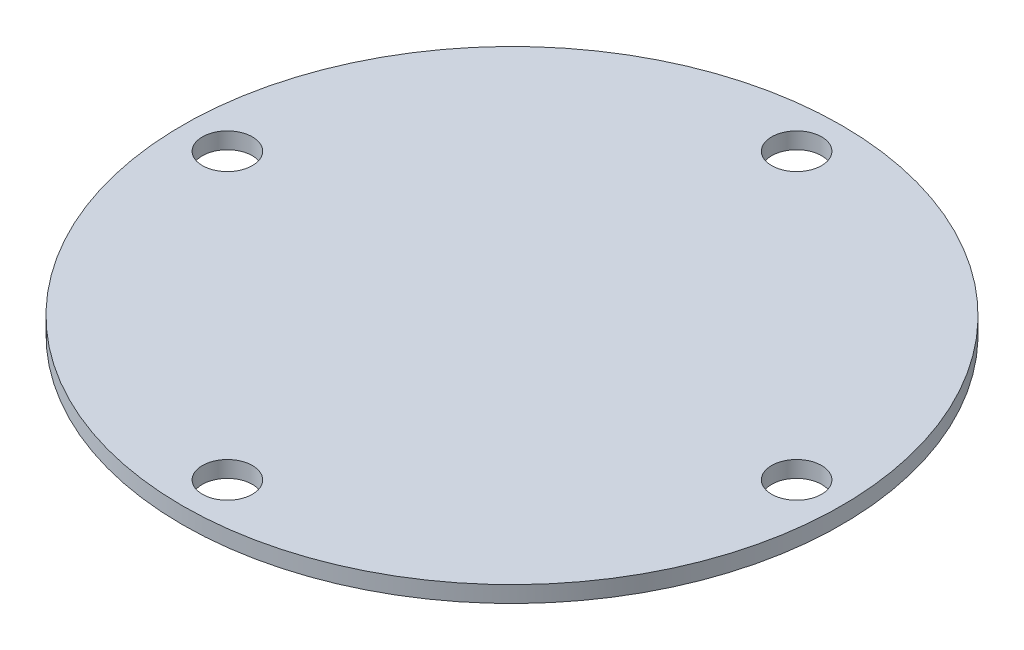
ISO-10303-21;
HEADER;
FILE_DESCRIPTION(('STEP AP214'),'2;1');
FILE_NAME('part.step','',(''),(''),'','','');
FILE_SCHEMA(('AUTOMOTIVE_DESIGN { 1 0 10303 214 1 1 1 1 }'));
ENDSEC;
DATA;
#1=APPLICATION_CONTEXT('core data for automotive mechanical design processes');
#2=APPLICATION_PROTOCOL_DEFINITION('international standard','automotive_design',2000,#1);
#3=PRODUCT_CONTEXT('',#1,'mechanical');
#4=PRODUCT('Part','Part','',(#3));
#5=PRODUCT_RELATED_PRODUCT_CATEGORY('part','',(#4));
#6=PRODUCT_DEFINITION_FORMATION('','',#4);
#7=PRODUCT_DEFINITION_CONTEXT('part definition',#1,'design');
#8=PRODUCT_DEFINITION('design','',#6,#7);
#9=PRODUCT_DEFINITION_SHAPE('','',#8);
#10=(LENGTH_UNIT() NAMED_UNIT(*) SI_UNIT(.MILLI.,.METRE.));
#11=(NAMED_UNIT(*) PLANE_ANGLE_UNIT() SI_UNIT($,.RADIAN.));
#12=(NAMED_UNIT(*) SI_UNIT($,.STERADIAN.) SOLID_ANGLE_UNIT());
#13=UNCERTAINTY_MEASURE_WITH_UNIT(LENGTH_MEASURE(1.E-05),#10,'distance_accuracy_value','');
#14=(GEOMETRIC_REPRESENTATION_CONTEXT(3) GLOBAL_UNCERTAINTY_ASSIGNED_CONTEXT((#13)) GLOBAL_UNIT_ASSIGNED_CONTEXT((#10,
#11,#12)) REPRESENTATION_CONTEXT('',''));
#15=CARTESIAN_POINT('',(0.,0.,0.));
#16=DIRECTION('',(0.,0.,1.));
#17=DIRECTION('',(1.,0.,0.));
#18=AXIS2_PLACEMENT_3D('',#15,#16,#17);
#19=CARTESIAN_POINT('',(0.,1.64,0.));
#20=DIRECTION('',(0.,1.,0.));
#21=DIRECTION('',(0.,0.,1.));
#22=AXIS2_PLACEMENT_3D('',#19,#20,#21);
#23=PLANE('',#22);
#24=CARTESIAN_POINT('',(2.8334147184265E-12,1.64,28.5));
#25=DIRECTION('',(0.,1.,0.));
#26=DIRECTION('',(0.,0.,1.));
#27=AXIS2_PLACEMENT_3D('',#24,#25,#26);
#28=CIRCLE('',#27,2.5);
#29=CARTESIAN_POINT('',(2.8334147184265E-12,1.64,31.));
#30=VERTEX_POINT('',#29);
#31=EDGE_CURVE('E64',#30,#30,#28,.T.);
#32=ORIENTED_EDGE('',*,*,#31,.F.);
#33=EDGE_LOOP('',(#32));
#34=FACE_BOUND('',#33,.T.);
#35=CARTESIAN_POINT('',(0.,1.64,-28.5));
#36=DIRECTION('',(0.,1.,0.));
#37=DIRECTION('',(0.,0.,1.));
#38=AXIS2_PLACEMENT_3D('',#35,#36,#37);
#39=CIRCLE('',#38,2.5);
#40=CARTESIAN_POINT('',(0.,1.64,-26.));
#41=VERTEX_POINT('',#40);
#42=EDGE_CURVE('E50',#41,#41,#39,.T.);
#43=ORIENTED_EDGE('',*,*,#42,.F.);
#44=EDGE_LOOP('',(#43));
#45=FACE_BOUND('',#44,.T.);
#46=CARTESIAN_POINT('',(0.,1.64,0.));
#47=DIRECTION('',(0.,1.,0.));
#48=DIRECTION('',(0.,0.,1.));
#49=AXIS2_PLACEMENT_3D('',#46,#47,#48);
#50=CIRCLE('',#49,33.);
#51=CARTESIAN_POINT('',(0.,1.64,33.));
#52=VERTEX_POINT('',#51);
#53=EDGE_CURVE('E10',#52,#52,#50,.T.);
#54=ORIENTED_EDGE('',*,*,#53,.T.);
#55=EDGE_LOOP('',(#54));
#56=FACE_BOUND('',#55,.T.);
#57=CARTESIAN_POINT('',(28.5000000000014,1.64,-1.41670735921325E-12));
#58=DIRECTION('',(0.,1.,0.));
#59=DIRECTION('',(0.,0.,1.));
#60=AXIS2_PLACEMENT_3D('',#57,#58,#59);
#61=CIRCLE('',#60,2.5);
#62=CARTESIAN_POINT('',(28.5000000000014,1.64,2.49999999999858));
#63=VERTEX_POINT('',#62);
#64=EDGE_CURVE('E56',#63,#63,#61,.T.);
#65=ORIENTED_EDGE('',*,*,#64,.F.);
#66=EDGE_LOOP('',(#65));
#67=FACE_BOUND('',#66,.T.);
#68=CARTESIAN_POINT('',(-28.4999999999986,1.64,1.42019760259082E-12));
#69=DIRECTION('',(0.,1.,0.));
#70=DIRECTION('',(0.,0.,1.));
#71=AXIS2_PLACEMENT_3D('',#68,#69,#70);
#72=CIRCLE('',#71,2.5);
#73=CARTESIAN_POINT('',(-28.4999999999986,1.64,2.50000000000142));
#74=VERTEX_POINT('',#73);
#75=EDGE_CURVE('E72',#74,#74,#72,.T.);
#76=ORIENTED_EDGE('',*,*,#75,.F.);
#77=EDGE_LOOP('',(#76));
#78=FACE_BOUND('',#77,.T.);
#79=ADVANCED_FACE('F37',(#34,#45,#56,#67,#78),#23,.T.);
#80=CARTESIAN_POINT('',(0.,0.,0.));
#81=DIRECTION('',(0.,1.,0.));
#82=DIRECTION('',(0.,0.,1.));
#83=AXIS2_PLACEMENT_3D('',#80,#81,#82);
#84=PLANE('',#83);
#85=CARTESIAN_POINT('',(0.,0.,0.));
#86=DIRECTION('',(0.,1.,0.));
#87=DIRECTION('',(0.,0.,1.));
#88=AXIS2_PLACEMENT_3D('',#85,#86,#87);
#89=CIRCLE('',#88,33.);
#90=CARTESIAN_POINT('',(0.,0.,33.));
#91=VERTEX_POINT('',#90);
#92=EDGE_CURVE('E41',#91,#91,#89,.T.);
#93=ORIENTED_EDGE('',*,*,#92,.F.);
#94=EDGE_LOOP('',(#93));
#95=FACE_BOUND('',#94,.T.);
#96=CARTESIAN_POINT('',(0.,0.,-28.5));
#97=DIRECTION('',(0.,1.,0.));
#98=DIRECTION('',(0.,0.,1.));
#99=AXIS2_PLACEMENT_3D('',#96,#97,#98);
#100=CIRCLE('',#99,2.5);
#101=CARTESIAN_POINT('',(0.,0.,-26.));
#102=VERTEX_POINT('',#101);
#103=EDGE_CURVE('E52',#102,#102,#100,.T.);
#104=ORIENTED_EDGE('',*,*,#103,.T.);
#105=EDGE_LOOP('',(#104));
#106=FACE_BOUND('',#105,.T.);
#107=CARTESIAN_POINT('',(28.5000000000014,0.,-1.41670735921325E-12));
#108=DIRECTION('',(0.,1.,0.));
#109=DIRECTION('',(0.,0.,1.));
#110=AXIS2_PLACEMENT_3D('',#107,#108,#109);
#111=CIRCLE('',#110,2.5);
#112=CARTESIAN_POINT('',(28.5000000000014,0.,2.49999999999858));
#113=VERTEX_POINT('',#112);
#114=EDGE_CURVE('E60',#113,#113,#111,.T.);
#115=ORIENTED_EDGE('',*,*,#114,.T.);
#116=EDGE_LOOP('',(#115));
#117=FACE_BOUND('',#116,.T.);
#118=CARTESIAN_POINT('',(2.8334147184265E-12,0.,28.5));
#119=DIRECTION('',(0.,1.,0.));
#120=DIRECTION('',(0.,0.,1.));
#121=AXIS2_PLACEMENT_3D('',#118,#119,#120);
#122=CIRCLE('',#121,2.5);
#123=CARTESIAN_POINT('',(2.8334147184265E-12,0.,31.));
#124=VERTEX_POINT('',#123);
#125=EDGE_CURVE('E68',#124,#124,#122,.T.);
#126=ORIENTED_EDGE('',*,*,#125,.T.);
#127=EDGE_LOOP('',(#126));
#128=FACE_BOUND('',#127,.T.);
#129=CARTESIAN_POINT('',(-28.4999999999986,0.,1.42019760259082E-12));
#130=DIRECTION('',(0.,1.,0.));
#131=DIRECTION('',(0.,0.,1.));
#132=AXIS2_PLACEMENT_3D('',#129,#130,#131);
#133=CIRCLE('',#132,2.5);
#134=CARTESIAN_POINT('',(-28.4999999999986,0.,2.50000000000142));
#135=VERTEX_POINT('',#134);
#136=EDGE_CURVE('E76',#135,#135,#133,.T.);
#137=ORIENTED_EDGE('',*,*,#136,.T.);
#138=EDGE_LOOP('',(#137));
#139=FACE_BOUND('',#138,.T.);
#140=ADVANCED_FACE('F88',(#95,#106,#117,#128,#139),#84,.F.);
#141=CARTESIAN_POINT('',(0.,1.64,0.));
#142=DIRECTION('',(0.,-1.,0.));
#143=DIRECTION('',(0.,0.,-1.));
#144=AXIS2_PLACEMENT_3D('',#141,#142,#143);
#145=CYLINDRICAL_SURFACE('',#144,33.);
#146=ORIENTED_EDGE('',*,*,#53,.F.);
#147=EDGE_LOOP('',(#146));
#148=FACE_BOUND('',#147,.T.);
#149=ORIENTED_EDGE('',*,*,#92,.T.);
#150=EDGE_LOOP('',(#149));
#151=FACE_BOUND('',#150,.T.);
#152=ADVANCED_FACE('F39',(#148,#151),#145,.T.);
#153=CARTESIAN_POINT('',(0.,1.64,-28.5));
#154=DIRECTION('',(0.,-1.,0.));
#155=DIRECTION('',(0.,0.,-1.));
#156=AXIS2_PLACEMENT_3D('',#153,#154,#155);
#157=CYLINDRICAL_SURFACE('',#156,2.5);
#158=ORIENTED_EDGE('',*,*,#42,.T.);
#159=EDGE_LOOP('',(#158));
#160=FACE_BOUND('',#159,.T.);
#161=ORIENTED_EDGE('',*,*,#103,.F.);
#162=EDGE_LOOP('',(#161));
#163=FACE_BOUND('',#162,.T.);
#164=ADVANCED_FACE('F98',(#160,#163),#157,.F.);
#165=CARTESIAN_POINT('',(28.5000000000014,1.64,-1.41670735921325E-12));
#166=DIRECTION('',(0.,-1.,0.));
#167=DIRECTION('',(0.,0.,-1.));
#168=AXIS2_PLACEMENT_3D('',#165,#166,#167);
#169=CYLINDRICAL_SURFACE('',#168,2.5);
#170=ORIENTED_EDGE('',*,*,#64,.T.);
#171=EDGE_LOOP('',(#170));
#172=FACE_BOUND('',#171,.T.);
#173=ORIENTED_EDGE('',*,*,#114,.F.);
#174=EDGE_LOOP('',(#173));
#175=FACE_BOUND('',#174,.T.);
#176=ADVANCED_FACE('F101',(#172,#175),#169,.F.);
#177=CARTESIAN_POINT('',(2.8334147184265E-12,1.64,28.5));
#178=DIRECTION('',(0.,-1.,0.));
#179=DIRECTION('',(0.,0.,-1.));
#180=AXIS2_PLACEMENT_3D('',#177,#178,#179);
#181=CYLINDRICAL_SURFACE('',#180,2.5);
#182=ORIENTED_EDGE('',*,*,#31,.T.);
#183=EDGE_LOOP('',(#182));
#184=FACE_BOUND('',#183,.T.);
#185=ORIENTED_EDGE('',*,*,#125,.F.);
#186=EDGE_LOOP('',(#185));
#187=FACE_BOUND('',#186,.T.);
#188=ADVANCED_FACE('F105',(#184,#187),#181,.F.);
#189=CARTESIAN_POINT('',(-28.4999999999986,1.64,1.42019760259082E-12));
#190=DIRECTION('',(0.,-1.,0.));
#191=DIRECTION('',(0.,0.,-1.));
#192=AXIS2_PLACEMENT_3D('',#189,#190,#191);
#193=CYLINDRICAL_SURFACE('',#192,2.5);
#194=ORIENTED_EDGE('',*,*,#75,.T.);
#195=EDGE_LOOP('',(#194));
#196=FACE_BOUND('',#195,.T.);
#197=ORIENTED_EDGE('',*,*,#136,.F.);
#198=EDGE_LOOP('',(#197));
#199=FACE_BOUND('',#198,.T.);
#200=ADVANCED_FACE('F84',(#196,#199),#193,.F.);
#201=CLOSED_SHELL('',(#79,#140,#152,#164,#176,#188,#200));
#202=MANIFOLD_SOLID_BREP('B2',#201);
#203=ADVANCED_BREP_SHAPE_REPRESENTATION('',(#18,#202),#14);
#204=SHAPE_DEFINITION_REPRESENTATION(#9,#203);
ENDSEC;
END-ISO-10303-21;
